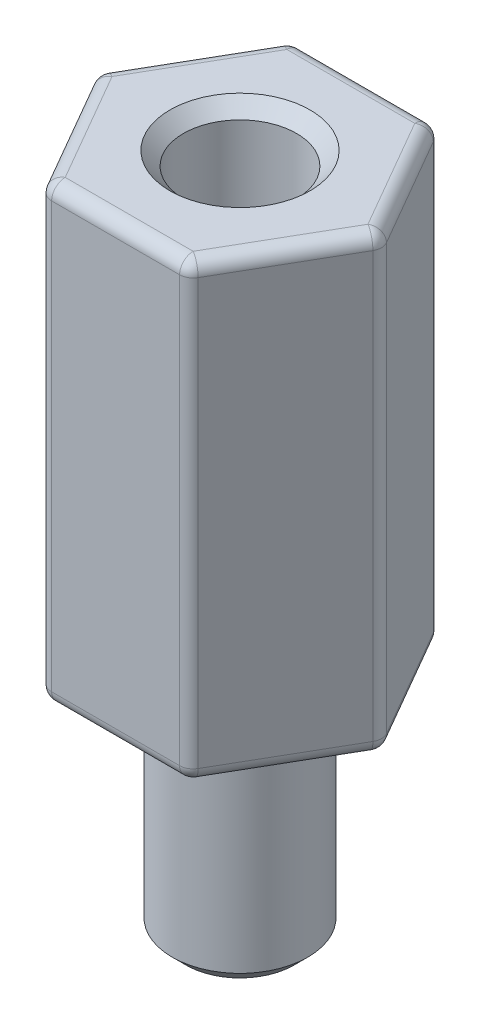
ISO-10303-21;
HEADER;
FILE_DESCRIPTION(('STEP AP214'),'2;1');
FILE_NAME('part.step','',(''),(''),'','','');
FILE_SCHEMA(('AUTOMOTIVE_DESIGN { 1 0 10303 214 1 1 1 1 }'));
ENDSEC;
DATA;
#1=APPLICATION_CONTEXT('core data for automotive mechanical design processes');
#2=APPLICATION_PROTOCOL_DEFINITION('international standard','automotive_design',2000,#1);
#3=PRODUCT_CONTEXT('',#1,'mechanical');
#4=PRODUCT('Part','Part','',(#3));
#5=PRODUCT_RELATED_PRODUCT_CATEGORY('part','',(#4));
#6=PRODUCT_DEFINITION_FORMATION('','',#4);
#7=PRODUCT_DEFINITION_CONTEXT('part definition',#1,'design');
#8=PRODUCT_DEFINITION('design','',#6,#7);
#9=PRODUCT_DEFINITION_SHAPE('','',#8);
#10=(LENGTH_UNIT() NAMED_UNIT(*) SI_UNIT(.MILLI.,.METRE.));
#11=(NAMED_UNIT(*) PLANE_ANGLE_UNIT() SI_UNIT($,.RADIAN.));
#12=(NAMED_UNIT(*) SI_UNIT($,.STERADIAN.) SOLID_ANGLE_UNIT());
#13=UNCERTAINTY_MEASURE_WITH_UNIT(LENGTH_MEASURE(1.E-05),#10,'distance_accuracy_value','');
#14=(GEOMETRIC_REPRESENTATION_CONTEXT(3) GLOBAL_UNCERTAINTY_ASSIGNED_CONTEXT((#13)) GLOBAL_UNIT_ASSIGNED_CONTEXT((#10,
#11,#12)) REPRESENTATION_CONTEXT('',''));
#15=CARTESIAN_POINT('',(0.,0.,0.));
#16=DIRECTION('',(0.,0.,1.));
#17=DIRECTION('',(1.,0.,0.));
#18=AXIS2_PLACEMENT_3D('',#15,#16,#17);
#19=CARTESIAN_POINT('',(0.,10.,0.));
#20=DIRECTION('',(0.,1.,0.));
#21=DIRECTION('',(0.,0.,1.));
#22=AXIS2_PLACEMENT_3D('',#19,#20,#21);
#23=PLANE('',#22);
#24=CARTESIAN_POINT('',(0.,10.,0.));
#25=DIRECTION('',(0.,1.,0.));
#26=DIRECTION('',(0.,0.,1.));
#27=AXIS2_PLACEMENT_3D('',#24,#25,#26);
#28=CIRCLE('',#27,1.55);
#29=CARTESIAN_POINT('',(0.,10.,1.55));
#30=VERTEX_POINT('',#29);
#31=EDGE_CURVE('E285',#30,#30,#28,.F.);
#32=ORIENTED_EDGE('',*,*,#31,.T.);
#33=EDGE_LOOP('',(#32));
#34=FACE_BOUND('',#33,.T.);
#35=DIRECTION('',(-0.5,0.,0.866025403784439));
#36=VECTOR('',#35,1.);
#37=CARTESIAN_POINT('',(-2.82901631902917,10.,0.));
#38=LINE('',#37,#36);
#39=CARTESIAN_POINT('',(-1.41450815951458,10.,-2.45));
#40=VERTEX_POINT('',#39);
#41=CARTESIAN_POINT('',(-2.82901631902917,10.,0.));
#42=VERTEX_POINT('',#41);
#43=EDGE_CURVE('E59',#40,#42,#38,.T.);
#44=ORIENTED_EDGE('',*,*,#43,.T.);
#45=DIRECTION('',(0.5,0.,0.866025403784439));
#46=VECTOR('',#45,1.);
#47=CARTESIAN_POINT('',(-1.41450815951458,10.,2.45));
#48=LINE('',#47,#46);
#49=CARTESIAN_POINT('',(-1.41450815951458,10.,2.45));
#50=VERTEX_POINT('',#49);
#51=EDGE_CURVE('E567',#42,#50,#48,.T.);
#52=ORIENTED_EDGE('',*,*,#51,.T.);
#53=DIRECTION('',(1.,0.,0.));
#54=VECTOR('',#53,1.);
#55=CARTESIAN_POINT('',(1.41450815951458,10.,2.45));
#56=LINE('',#55,#54);
#57=CARTESIAN_POINT('',(1.41450815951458,10.,2.45));
#58=VERTEX_POINT('',#57);
#59=EDGE_CURVE('E559',#50,#58,#56,.T.);
#60=ORIENTED_EDGE('',*,*,#59,.T.);
#61=DIRECTION('',(0.5,0.,-0.866025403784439));
#62=VECTOR('',#61,1.);
#63=CARTESIAN_POINT('',(2.82901631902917,10.,0.));
#64=LINE('',#63,#62);
#65=CARTESIAN_POINT('',(2.82901631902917,10.,0.));
#66=VERTEX_POINT('',#65);
#67=EDGE_CURVE('E561',#58,#66,#64,.T.);
#68=ORIENTED_EDGE('',*,*,#67,.T.);
#69=DIRECTION('',(-0.5,0.,-0.866025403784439));
#70=VECTOR('',#69,1.);
#71=CARTESIAN_POINT('',(1.41450815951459,10.,-2.45));
#72=LINE('',#71,#70);
#73=CARTESIAN_POINT('',(1.41450815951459,10.,-2.45));
#74=VERTEX_POINT('',#73);
#75=EDGE_CURVE('E563',#66,#74,#72,.T.);
#76=ORIENTED_EDGE('',*,*,#75,.T.);
#77=DIRECTION('',(-1.,0.,0.));
#78=VECTOR('',#77,1.);
#79=CARTESIAN_POINT('',(-1.41450815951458,10.,-2.45));
#80=LINE('',#79,#78);
#81=EDGE_CURVE('E64',#74,#40,#80,.T.);
#82=ORIENTED_EDGE('',*,*,#81,.T.);
#83=EDGE_LOOP('',(#44,#52,#60,#68,#76,#82));
#84=FACE_BOUND('',#83,.T.);
#85=ADVANCED_FACE('F44',(#34,#84),#23,.T.);
#86=CARTESIAN_POINT('',(0.,0.,0.));
#87=DIRECTION('',(0.,1.,0.));
#88=DIRECTION('',(0.,0.,1.));
#89=AXIS2_PLACEMENT_3D('',#86,#87,#88);
#90=PLANE('',#89);
#91=CARTESIAN_POINT('',(0.,0.,0.));
#92=DIRECTION('',(0.,1.,0.));
#93=DIRECTION('',(0.,0.,1.));
#94=AXIS2_PLACEMENT_3D('',#91,#92,#93);
#95=CIRCLE('',#94,1.8);
#96=CARTESIAN_POINT('',(0.,0.,1.8));
#97=VERTEX_POINT('',#96);
#98=EDGE_CURVE('E11',#97,#97,#95,.T.);
#99=ORIENTED_EDGE('',*,*,#98,.T.);
#100=EDGE_LOOP('',(#99));
#101=FACE_BOUND('',#100,.T.);
#102=DIRECTION('',(1.,0.,0.));
#103=VECTOR('',#102,1.);
#104=CARTESIAN_POINT('',(0.,0.,2.45));
#105=LINE('',#104,#103);
#106=CARTESIAN_POINT('',(1.41450815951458,0.,2.45));
#107=VERTEX_POINT('',#106);
#108=CARTESIAN_POINT('',(-1.41450815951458,0.,2.45));
#109=VERTEX_POINT('',#108);
#110=EDGE_CURVE('E179',#107,#109,#105,.F.);
#111=ORIENTED_EDGE('',*,*,#110,.T.);
#112=DIRECTION('',(0.5,0.,0.866025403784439));
#113=VECTOR('',#112,1.);
#114=CARTESIAN_POINT('',(-2.12176223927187,0.,1.225));
#115=LINE('',#114,#113);
#116=CARTESIAN_POINT('',(-2.82901631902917,0.,0.));
#117=VERTEX_POINT('',#116);
#118=EDGE_CURVE('E205',#109,#117,#115,.F.);
#119=ORIENTED_EDGE('',*,*,#118,.T.);
#120=DIRECTION('',(-0.5,0.,0.866025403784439));
#121=VECTOR('',#120,1.);
#122=CARTESIAN_POINT('',(-2.12176223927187,0.,-1.225));
#123=LINE('',#122,#121);
#124=CARTESIAN_POINT('',(-1.41450815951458,0.,-2.45));
#125=VERTEX_POINT('',#124);
#126=EDGE_CURVE('E520',#117,#125,#123,.F.);
#127=ORIENTED_EDGE('',*,*,#126,.T.);
#128=DIRECTION('',(-1.,0.,0.));
#129=VECTOR('',#128,1.);
#130=CARTESIAN_POINT('',(0.,0.,-2.45));
#131=LINE('',#130,#129);
#132=CARTESIAN_POINT('',(1.41450815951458,0.,-2.45));
#133=VERTEX_POINT('',#132);
#134=EDGE_CURVE('E518',#125,#133,#131,.F.);
#135=ORIENTED_EDGE('',*,*,#134,.T.);
#136=DIRECTION('',(-0.5,0.,-0.866025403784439));
#137=VECTOR('',#136,1.);
#138=CARTESIAN_POINT('',(2.12176223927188,0.,-1.225));
#139=LINE('',#138,#137);
#140=CARTESIAN_POINT('',(2.82901631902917,0.,0.));
#141=VERTEX_POINT('',#140);
#142=EDGE_CURVE('E516',#133,#141,#139,.F.);
#143=ORIENTED_EDGE('',*,*,#142,.T.);
#144=DIRECTION('',(0.5,0.,-0.866025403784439));
#145=VECTOR('',#144,1.);
#146=CARTESIAN_POINT('',(2.12176223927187,0.,1.225));
#147=LINE('',#146,#145);
#148=EDGE_CURVE('E514',#141,#107,#147,.F.);
#149=ORIENTED_EDGE('',*,*,#148,.T.);
#150=EDGE_LOOP('',(#111,#119,#127,#135,#143,#149));
#151=FACE_BOUND('',#150,.T.);
#152=ADVANCED_FACE('F303',(#101,#151),#90,.F.);
#153=CARTESIAN_POINT('',(1.58771324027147,10.,-2.75));
#154=DIRECTION('',(0.,0.,1.));
#155=DIRECTION('',(1.,0.,0.));
#156=AXIS2_PLACEMENT_3D('',#153,#154,#155);
#157=PLANE('',#156);
#158=DIRECTION('',(0.,-1.,0.));
#159=VECTOR('',#158,1.);
#160=CARTESIAN_POINT('',(1.41450815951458,10.,-2.75));
#161=LINE('',#160,#159);
#162=CARTESIAN_POINT('',(1.41450815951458,9.7,-2.75));
#163=VERTEX_POINT('',#162);
#164=CARTESIAN_POINT('',(1.41450815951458,0.3,-2.75));
#165=VERTEX_POINT('',#164);
#166=EDGE_CURVE('E483',#163,#165,#161,.T.);
#167=ORIENTED_EDGE('',*,*,#166,.T.);
#168=DIRECTION('',(-1.,0.,0.));
#169=VECTOR('',#168,1.);
#170=CARTESIAN_POINT('',(1.58771324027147,0.3,-2.75));
#171=LINE('',#170,#169);
#172=CARTESIAN_POINT('',(-1.41450815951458,0.3,-2.75));
#173=VERTEX_POINT('',#172);
#174=EDGE_CURVE('E537',#165,#173,#171,.T.);
#175=ORIENTED_EDGE('',*,*,#174,.T.);
#176=DIRECTION('',(0.,-1.,0.));
#177=VECTOR('',#176,1.);
#178=CARTESIAN_POINT('',(-1.41450815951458,10.,-2.75));
#179=LINE('',#178,#177);
#180=CARTESIAN_POINT('',(-1.41450815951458,9.7,-2.75));
#181=VERTEX_POINT('',#180);
#182=EDGE_CURVE('E480',#173,#181,#179,.F.);
#183=ORIENTED_EDGE('',*,*,#182,.T.);
#184=DIRECTION('',(-1.,0.,0.));
#185=VECTOR('',#184,1.);
#186=CARTESIAN_POINT('',(1.41450815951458,9.7,-2.75));
#187=LINE('',#186,#185);
#188=EDGE_CURVE('E535',#181,#163,#187,.F.);
#189=ORIENTED_EDGE('',*,*,#188,.T.);
#190=EDGE_LOOP('',(#167,#175,#183,#189));
#191=FACE_BOUND('',#190,.T.);
#192=ADVANCED_FACE('F309',(#191),#157,.F.);
#193=CARTESIAN_POINT('',(-1.58771324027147,10.,-2.75));
#194=DIRECTION('',(0.866025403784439,0.,0.5));
#195=DIRECTION('',(0.5,0.,-0.866025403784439));
#196=AXIS2_PLACEMENT_3D('',#193,#194,#195);
#197=PLANE('',#196);
#198=DIRECTION('',(0.,-1.,0.));
#199=VECTOR('',#198,1.);
#200=CARTESIAN_POINT('',(-1.67431578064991,10.,-2.6));
#201=LINE('',#200,#199);
#202=CARTESIAN_POINT('',(-1.67431578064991,9.7,-2.6));
#203=VERTEX_POINT('',#202);
#204=CARTESIAN_POINT('',(-1.67431578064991,0.3,-2.6));
#205=VERTEX_POINT('',#204);
#206=EDGE_CURVE('E192',#203,#205,#201,.T.);
#207=ORIENTED_EDGE('',*,*,#206,.T.);
#208=DIRECTION('',(-0.5,0.,0.866025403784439));
#209=VECTOR('',#208,1.);
#210=CARTESIAN_POINT('',(-1.58771324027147,0.3,-2.75));
#211=LINE('',#210,#209);
#212=CARTESIAN_POINT('',(-3.0888239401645,0.3,-0.15));
#213=VERTEX_POINT('',#212);
#214=EDGE_CURVE('E529',#205,#213,#211,.T.);
#215=ORIENTED_EDGE('',*,*,#214,.T.);
#216=DIRECTION('',(0.,-1.,0.));
#217=VECTOR('',#216,1.);
#218=CARTESIAN_POINT('',(-3.0888239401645,10.,-0.15));
#219=LINE('',#218,#217);
#220=CARTESIAN_POINT('',(-3.0888239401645,9.7,-0.15));
#221=VERTEX_POINT('',#220);
#222=EDGE_CURVE('E500',#213,#221,#219,.F.);
#223=ORIENTED_EDGE('',*,*,#222,.T.);
#224=DIRECTION('',(-0.5,0.,0.866025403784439));
#225=VECTOR('',#224,1.);
#226=CARTESIAN_POINT('',(-1.67431578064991,9.7,-2.6));
#227=LINE('',#226,#225);
#228=EDGE_CURVE('E527',#221,#203,#227,.F.);
#229=ORIENTED_EDGE('',*,*,#228,.T.);
#230=EDGE_LOOP('',(#207,#215,#223,#229));
#231=FACE_BOUND('',#230,.T.);
#232=ADVANCED_FACE('F330',(#231),#197,.F.);
#233=CARTESIAN_POINT('',(-3.17542648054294,10.,0.));
#234=DIRECTION('',(0.866025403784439,0.,-0.5));
#235=DIRECTION('',(-0.5,0.,-0.866025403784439));
#236=AXIS2_PLACEMENT_3D('',#233,#234,#235);
#237=PLANE('',#236);
#238=DIRECTION('',(0.,-1.,0.));
#239=VECTOR('',#238,1.);
#240=CARTESIAN_POINT('',(-3.0888239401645,10.,0.149999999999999));
#241=LINE('',#240,#239);
#242=CARTESIAN_POINT('',(-3.0888239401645,9.7,0.149999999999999));
#243=VERTEX_POINT('',#242);
#244=CARTESIAN_POINT('',(-3.0888239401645,0.3,0.149999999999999));
#245=VERTEX_POINT('',#244);
#246=EDGE_CURVE('E175',#243,#245,#241,.T.);
#247=ORIENTED_EDGE('',*,*,#246,.T.);
#248=DIRECTION('',(0.5,0.,0.866025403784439));
#249=VECTOR('',#248,1.);
#250=CARTESIAN_POINT('',(-3.17542648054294,0.3,0.));
#251=LINE('',#250,#249);
#252=CARTESIAN_POINT('',(-1.67431578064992,0.3,2.6));
#253=VERTEX_POINT('',#252);
#254=EDGE_CURVE('E170',#245,#253,#251,.T.);
#255=ORIENTED_EDGE('',*,*,#254,.T.);
#256=DIRECTION('',(0.,-1.,0.));
#257=VECTOR('',#256,1.);
#258=CARTESIAN_POINT('',(-1.67431578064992,10.,2.6));
#259=LINE('',#258,#257);
#260=CARTESIAN_POINT('',(-1.67431578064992,9.7,2.6));
#261=VERTEX_POINT('',#260);
#262=EDGE_CURVE('E173',#253,#261,#259,.F.);
#263=ORIENTED_EDGE('',*,*,#262,.T.);
#264=DIRECTION('',(0.5,0.,0.866025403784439));
#265=VECTOR('',#264,1.);
#266=CARTESIAN_POINT('',(-3.0888239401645,9.7,0.149999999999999));
#267=LINE('',#266,#265);
#268=EDGE_CURVE('E180',#261,#243,#267,.F.);
#269=ORIENTED_EDGE('',*,*,#268,.T.);
#270=EDGE_LOOP('',(#247,#255,#263,#269));
#271=FACE_BOUND('',#270,.T.);
#272=ADVANCED_FACE('F172',(#271),#237,.F.);
#273=CARTESIAN_POINT('',(-1.58771324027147,10.,2.75));
#274=DIRECTION('',(0.,0.,-1.));
#275=DIRECTION('',(-1.,0.,0.));
#276=AXIS2_PLACEMENT_3D('',#273,#274,#275);
#277=PLANE('',#276);
#278=DIRECTION('',(0.,-1.,0.));
#279=VECTOR('',#278,1.);
#280=CARTESIAN_POINT('',(-1.41450815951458,10.,2.75));
#281=LINE('',#280,#279);
#282=CARTESIAN_POINT('',(-1.41450815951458,9.7,2.75));
#283=VERTEX_POINT('',#282);
#284=CARTESIAN_POINT('',(-1.41450815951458,0.3,2.75));
#285=VERTEX_POINT('',#284);
#286=EDGE_CURVE('E509',#283,#285,#281,.T.);
#287=ORIENTED_EDGE('',*,*,#286,.T.);
#288=DIRECTION('',(1.,0.,0.));
#289=VECTOR('',#288,1.);
#290=CARTESIAN_POINT('',(-1.58771324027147,0.3,2.75));
#291=LINE('',#290,#289);
#292=CARTESIAN_POINT('',(1.41450815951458,0.3,2.75));
#293=VERTEX_POINT('',#292);
#294=EDGE_CURVE('E214',#285,#293,#291,.T.);
#295=ORIENTED_EDGE('',*,*,#294,.T.);
#296=DIRECTION('',(0.,-1.,0.));
#297=VECTOR('',#296,1.);
#298=CARTESIAN_POINT('',(1.41450815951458,10.,2.75));
#299=LINE('',#298,#297);
#300=CARTESIAN_POINT('',(1.41450815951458,9.7,2.75));
#301=VERTEX_POINT('',#300);
#302=EDGE_CURVE('E506',#293,#301,#299,.F.);
#303=ORIENTED_EDGE('',*,*,#302,.T.);
#304=DIRECTION('',(1.,0.,0.));
#305=VECTOR('',#304,1.);
#306=CARTESIAN_POINT('',(-1.41450815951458,9.7,2.75));
#307=LINE('',#306,#305);
#308=EDGE_CURVE('E568',#301,#283,#307,.F.);
#309=ORIENTED_EDGE('',*,*,#308,.T.);
#310=EDGE_LOOP('',(#287,#295,#303,#309));
#311=FACE_BOUND('',#310,.T.);
#312=ADVANCED_FACE('F323',(#311),#277,.F.);
#313=CARTESIAN_POINT('',(1.58771324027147,10.,2.75));
#314=DIRECTION('',(-0.866025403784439,0.,-0.5));
#315=DIRECTION('',(-0.5,0.,0.866025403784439));
#316=AXIS2_PLACEMENT_3D('',#313,#314,#315);
#317=PLANE('',#316);
#318=DIRECTION('',(0.,-1.,0.));
#319=VECTOR('',#318,1.);
#320=CARTESIAN_POINT('',(1.67431578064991,10.,2.6));
#321=LINE('',#320,#319);
#322=CARTESIAN_POINT('',(1.67431578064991,9.7,2.6));
#323=VERTEX_POINT('',#322);
#324=CARTESIAN_POINT('',(1.67431578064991,0.3,2.6));
#325=VERTEX_POINT('',#324);
#326=EDGE_CURVE('E494',#323,#325,#321,.T.);
#327=ORIENTED_EDGE('',*,*,#326,.T.);
#328=DIRECTION('',(0.5,0.,-0.866025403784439));
#329=VECTOR('',#328,1.);
#330=CARTESIAN_POINT('',(1.58771324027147,0.3,2.75));
#331=LINE('',#330,#329);
#332=CARTESIAN_POINT('',(3.0888239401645,0.3,0.149999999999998));
#333=VERTEX_POINT('',#332);
#334=EDGE_CURVE('E553',#325,#333,#331,.T.);
#335=ORIENTED_EDGE('',*,*,#334,.T.);
#336=DIRECTION('',(0.,-1.,0.));
#337=VECTOR('',#336,1.);
#338=CARTESIAN_POINT('',(3.0888239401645,10.,0.149999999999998));
#339=LINE('',#338,#337);
#340=CARTESIAN_POINT('',(3.0888239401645,9.7,0.149999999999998));
#341=VERTEX_POINT('',#340);
#342=EDGE_CURVE('E497',#333,#341,#339,.F.);
#343=ORIENTED_EDGE('',*,*,#342,.T.);
#344=DIRECTION('',(0.5,0.,-0.866025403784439));
#345=VECTOR('',#344,1.);
#346=CARTESIAN_POINT('',(1.67431578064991,9.7,2.6));
#347=LINE('',#346,#345);
#348=EDGE_CURVE('E551',#341,#323,#347,.F.);
#349=ORIENTED_EDGE('',*,*,#348,.T.);
#350=EDGE_LOOP('',(#327,#335,#343,#349));
#351=FACE_BOUND('',#350,.T.);
#352=ADVANCED_FACE('F319',(#351),#317,.F.);
#353=CARTESIAN_POINT('',(3.17542648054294,10.,0.));
#354=DIRECTION('',(-0.866025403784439,0.,0.5));
#355=DIRECTION('',(0.5,0.,0.866025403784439));
#356=AXIS2_PLACEMENT_3D('',#353,#354,#355);
#357=PLANE('',#356);
#358=DIRECTION('',(0.,-1.,0.));
#359=VECTOR('',#358,1.);
#360=CARTESIAN_POINT('',(3.0888239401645,10.,-0.150000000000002));
#361=LINE('',#360,#359);
#362=CARTESIAN_POINT('',(3.0888239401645,9.7,-0.150000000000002));
#363=VERTEX_POINT('',#362);
#364=CARTESIAN_POINT('',(3.0888239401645,0.3,-0.150000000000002));
#365=VERTEX_POINT('',#364);
#366=EDGE_CURVE('E488',#363,#365,#361,.T.);
#367=ORIENTED_EDGE('',*,*,#366,.T.);
#368=DIRECTION('',(-0.5,0.,-0.866025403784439));
#369=VECTOR('',#368,1.);
#370=CARTESIAN_POINT('',(3.17542648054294,0.3,0.));
#371=LINE('',#370,#369);
#372=CARTESIAN_POINT('',(1.67431578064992,0.3,-2.6));
#373=VERTEX_POINT('',#372);
#374=EDGE_CURVE('E545',#365,#373,#371,.T.);
#375=ORIENTED_EDGE('',*,*,#374,.T.);
#376=DIRECTION('',(0.,-1.,0.));
#377=VECTOR('',#376,1.);
#378=CARTESIAN_POINT('',(1.67431578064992,10.,-2.6));
#379=LINE('',#378,#377);
#380=CARTESIAN_POINT('',(1.67431578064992,9.7,-2.6));
#381=VERTEX_POINT('',#380);
#382=EDGE_CURVE('E491',#373,#381,#379,.F.);
#383=ORIENTED_EDGE('',*,*,#382,.T.);
#384=DIRECTION('',(-0.5,0.,-0.866025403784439));
#385=VECTOR('',#384,1.);
#386=CARTESIAN_POINT('',(3.0888239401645,9.7,-0.150000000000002));
#387=LINE('',#386,#385);
#388=EDGE_CURVE('E543',#381,#363,#387,.F.);
#389=ORIENTED_EDGE('',*,*,#388,.T.);
#390=EDGE_LOOP('',(#367,#375,#383,#389));
#391=FACE_BOUND('',#390,.T.);
#392=ADVANCED_FACE('F316',(#391),#357,.F.);
#393=CARTESIAN_POINT('',(0.,10.,0.));
#394=DIRECTION('',(0.,-1.,0.));
#395=DIRECTION('',(0.,0.,-1.));
#396=AXIS2_PLACEMENT_3D('',#393,#394,#395);
#397=CYLINDRICAL_SURFACE('',#396,1.25);
#398=CARTESIAN_POINT('',(0.,9.7,0.));
#399=DIRECTION('',(0.,1.,0.));
#400=DIRECTION('',(0.,0.,1.));
#401=AXIS2_PLACEMENT_3D('',#398,#399,#400);
#402=CIRCLE('',#401,1.25);
#403=CARTESIAN_POINT('',(0.,9.7,1.25));
#404=VERTEX_POINT('',#403);
#405=EDGE_CURVE('E282',#404,#404,#402,.T.);
#406=ORIENTED_EDGE('',*,*,#405,.T.);
#407=EDGE_LOOP('',(#406));
#408=FACE_BOUND('',#407,.T.);
#409=CARTESIAN_POINT('',(0.,0.,0.));
#410=DIRECTION('',(0.,1.,0.));
#411=DIRECTION('',(0.,0.,1.));
#412=AXIS2_PLACEMENT_3D('',#409,#410,#411);
#413=CIRCLE('',#412,1.25);
#414=CARTESIAN_POINT('',(0.,0.,1.25));
#415=VERTEX_POINT('',#414);
#416=EDGE_CURVE('E245',#415,#415,#413,.T.);
#417=ORIENTED_EDGE('',*,*,#416,.F.);
#418=EDGE_LOOP('',(#417));
#419=FACE_BOUND('',#418,.T.);
#420=ADVANCED_FACE('F313',(#408,#419),#397,.F.);
#421=CARTESIAN_POINT('',(1.41450815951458,10.,-2.45));
#422=DIRECTION('',(0.,-1.,0.));
#423=DIRECTION('',(0.,0.,-1.));
#424=AXIS2_PLACEMENT_3D('',#421,#422,#423);
#425=CYLINDRICAL_SURFACE('',#424,0.3);
#426=ORIENTED_EDGE('',*,*,#382,.F.);
#427=CARTESIAN_POINT('',(1.41450815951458,0.3,-2.45));
#428=DIRECTION('',(0.,-1.,0.));
#429=DIRECTION('',(0.,0.,-1.));
#430=AXIS2_PLACEMENT_3D('',#427,#428,#429);
#431=CIRCLE('',#430,0.3);
#432=EDGE_CURVE('E541',#373,#165,#431,.F.);
#433=ORIENTED_EDGE('',*,*,#432,.T.);
#434=ORIENTED_EDGE('',*,*,#166,.F.);
#435=CARTESIAN_POINT('',(1.41450815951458,9.7,-2.45));
#436=DIRECTION('',(0.,-1.,0.));
#437=DIRECTION('',(0.,0.,-1.));
#438=AXIS2_PLACEMENT_3D('',#435,#436,#437);
#439=CIRCLE('',#438,0.3);
#440=EDGE_CURVE('E539',#163,#381,#439,.T.);
#441=ORIENTED_EDGE('',*,*,#440,.T.);
#442=EDGE_LOOP('',(#426,#433,#434,#441));
#443=FACE_BOUND('',#442,.T.);
#444=ADVANCED_FACE('F337',(#443),#425,.T.);
#445=CARTESIAN_POINT('',(2.82901631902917,10.,0.));
#446=DIRECTION('',(0.,-1.,0.));
#447=DIRECTION('',(0.,0.,-1.));
#448=AXIS2_PLACEMENT_3D('',#445,#446,#447);
#449=CYLINDRICAL_SURFACE('',#448,0.3);
#450=ORIENTED_EDGE('',*,*,#342,.F.);
#451=CARTESIAN_POINT('',(2.82901631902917,0.3,0.));
#452=DIRECTION('',(0.,-1.,0.));
#453=DIRECTION('',(0.,0.,-1.));
#454=AXIS2_PLACEMENT_3D('',#451,#452,#453);
#455=CIRCLE('',#454,0.3);
#456=EDGE_CURVE('E549',#333,#365,#455,.F.);
#457=ORIENTED_EDGE('',*,*,#456,.T.);
#458=ORIENTED_EDGE('',*,*,#366,.F.);
#459=CARTESIAN_POINT('',(2.82901631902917,9.7,0.));
#460=DIRECTION('',(0.,-1.,0.));
#461=DIRECTION('',(0.,0.,-1.));
#462=AXIS2_PLACEMENT_3D('',#459,#460,#461);
#463=CIRCLE('',#462,0.3);
#464=EDGE_CURVE('E547',#363,#341,#463,.T.);
#465=ORIENTED_EDGE('',*,*,#464,.T.);
#466=EDGE_LOOP('',(#450,#457,#458,#465));
#467=FACE_BOUND('',#466,.T.);
#468=ADVANCED_FACE('F340',(#467),#449,.T.);
#469=CARTESIAN_POINT('',(-1.41450815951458,10.,-2.45));
#470=DIRECTION('',(0.,-1.,0.));
#471=DIRECTION('',(0.,0.,-1.));
#472=AXIS2_PLACEMENT_3D('',#469,#470,#471);
#473=CYLINDRICAL_SURFACE('',#472,0.3);
#474=ORIENTED_EDGE('',*,*,#182,.F.);
#475=CARTESIAN_POINT('',(-1.41450815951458,0.3,-2.45));
#476=DIRECTION('',(0.,-1.,0.));
#477=DIRECTION('',(0.,0.,-1.));
#478=AXIS2_PLACEMENT_3D('',#475,#476,#477);
#479=CIRCLE('',#478,0.3);
#480=EDGE_CURVE('E533',#173,#205,#479,.F.);
#481=ORIENTED_EDGE('',*,*,#480,.T.);
#482=ORIENTED_EDGE('',*,*,#206,.F.);
#483=CARTESIAN_POINT('',(-1.41450815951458,9.7,-2.45));
#484=DIRECTION('',(0.,-1.,0.));
#485=DIRECTION('',(0.,0.,-1.));
#486=AXIS2_PLACEMENT_3D('',#483,#484,#485);
#487=CIRCLE('',#486,0.3);
#488=EDGE_CURVE('E531',#203,#181,#487,.T.);
#489=ORIENTED_EDGE('',*,*,#488,.T.);
#490=EDGE_LOOP('',(#474,#481,#482,#489));
#491=FACE_BOUND('',#490,.T.);
#492=ADVANCED_FACE('F344',(#491),#473,.T.);
#493=CARTESIAN_POINT('',(-2.82901631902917,10.,0.));
#494=DIRECTION('',(0.,-1.,0.));
#495=DIRECTION('',(0.,0.,-1.));
#496=AXIS2_PLACEMENT_3D('',#493,#494,#495);
#497=CYLINDRICAL_SURFACE('',#496,0.3);
#498=ORIENTED_EDGE('',*,*,#222,.F.);
#499=CARTESIAN_POINT('',(-2.82901631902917,0.3,0.));
#500=DIRECTION('',(0.,-1.,0.));
#501=DIRECTION('',(0.,0.,-1.));
#502=AXIS2_PLACEMENT_3D('',#499,#500,#501);
#503=CIRCLE('',#502,0.3);
#504=EDGE_CURVE('E525',#213,#245,#503,.F.);
#505=ORIENTED_EDGE('',*,*,#504,.T.);
#506=ORIENTED_EDGE('',*,*,#246,.F.);
#507=CARTESIAN_POINT('',(-2.82901631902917,9.7,0.));
#508=DIRECTION('',(0.,-1.,0.));
#509=DIRECTION('',(0.,0.,-1.));
#510=AXIS2_PLACEMENT_3D('',#507,#508,#509);
#511=CIRCLE('',#510,0.3);
#512=EDGE_CURVE('E523',#243,#221,#511,.T.);
#513=ORIENTED_EDGE('',*,*,#512,.T.);
#514=EDGE_LOOP('',(#498,#505,#506,#513));
#515=FACE_BOUND('',#514,.T.);
#516=ADVANCED_FACE('F348',(#515),#497,.T.);
#517=CARTESIAN_POINT('',(-1.41450815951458,10.,2.45));
#518=DIRECTION('',(0.,-1.,0.));
#519=DIRECTION('',(0.,0.,-1.));
#520=AXIS2_PLACEMENT_3D('',#517,#518,#519);
#521=CYLINDRICAL_SURFACE('',#520,0.3);
#522=ORIENTED_EDGE('',*,*,#262,.F.);
#523=CARTESIAN_POINT('',(-1.41450815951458,0.3,2.45));
#524=DIRECTION('',(0.,-1.,0.));
#525=DIRECTION('',(0.,0.,-1.));
#526=AXIS2_PLACEMENT_3D('',#523,#524,#525);
#527=CIRCLE('',#526,0.3);
#528=EDGE_CURVE('E188',#253,#285,#527,.F.);
#529=ORIENTED_EDGE('',*,*,#528,.T.);
#530=ORIENTED_EDGE('',*,*,#286,.F.);
#531=CARTESIAN_POINT('',(-1.41450815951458,9.7,2.45));
#532=DIRECTION('',(0.,-1.,0.));
#533=DIRECTION('',(0.,0.,-1.));
#534=AXIS2_PLACEMENT_3D('',#531,#532,#533);
#535=CIRCLE('',#534,0.3);
#536=EDGE_CURVE('E191',#283,#261,#535,.T.);
#537=ORIENTED_EDGE('',*,*,#536,.T.);
#538=EDGE_LOOP('',(#522,#529,#530,#537));
#539=FACE_BOUND('',#538,.T.);
#540=ADVANCED_FACE('F186',(#539),#521,.T.);
#541=CARTESIAN_POINT('',(1.41450815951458,10.,2.45));
#542=DIRECTION('',(0.,-1.,0.));
#543=DIRECTION('',(0.,0.,-1.));
#544=AXIS2_PLACEMENT_3D('',#541,#542,#543);
#545=CYLINDRICAL_SURFACE('',#544,0.3);
#546=ORIENTED_EDGE('',*,*,#302,.F.);
#547=CARTESIAN_POINT('',(1.41450815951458,0.3,2.45));
#548=DIRECTION('',(0.,-1.,0.));
#549=DIRECTION('',(0.,0.,-1.));
#550=AXIS2_PLACEMENT_3D('',#547,#548,#549);
#551=CIRCLE('',#550,0.3);
#552=EDGE_CURVE('E557',#293,#325,#551,.F.);
#553=ORIENTED_EDGE('',*,*,#552,.T.);
#554=ORIENTED_EDGE('',*,*,#326,.F.);
#555=CARTESIAN_POINT('',(1.41450815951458,9.7,2.45));
#556=DIRECTION('',(0.,-1.,0.));
#557=DIRECTION('',(0.,0.,-1.));
#558=AXIS2_PLACEMENT_3D('',#555,#556,#557);
#559=CIRCLE('',#558,0.3);
#560=EDGE_CURVE('E555',#323,#301,#559,.T.);
#561=ORIENTED_EDGE('',*,*,#560,.T.);
#562=EDGE_LOOP('',(#546,#553,#554,#561));
#563=FACE_BOUND('',#562,.T.);
#564=ADVANCED_FACE('F355',(#563),#545,.T.);
#565=CARTESIAN_POINT('',(1.41450815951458,0.3,-2.45));
#566=DIRECTION('',(0.,1.,0.));
#567=DIRECTION('',(0.,0.,1.));
#568=AXIS2_PLACEMENT_3D('',#565,#566,#567);
#569=SPHERICAL_SURFACE('',#568,0.3);
#570=CARTESIAN_POINT('',(1.41450815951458,0.3,-2.45));
#571=DIRECTION('',(-1.,0.,0.));
#572=DIRECTION('',(0.,0.,1.));
#573=AXIS2_PLACEMENT_3D('',#570,#571,#572);
#574=CIRCLE('',#573,0.3);
#575=EDGE_CURVE('E239',#165,#133,#574,.T.);
#576=ORIENTED_EDGE('',*,*,#575,.F.);
#577=ORIENTED_EDGE('',*,*,#432,.F.);
#578=CARTESIAN_POINT('',(1.41450815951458,0.3,-2.45));
#579=DIRECTION('',(0.499999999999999,0.,0.866025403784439));
#580=DIRECTION('',(0.866025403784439,0.,-0.499999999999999));
#581=AXIS2_PLACEMENT_3D('',#578,#579,#580);
#582=CIRCLE('',#581,0.3);
#583=EDGE_CURVE('E242',#133,#373,#582,.T.);
#584=ORIENTED_EDGE('',*,*,#583,.F.);
#585=EDGE_LOOP('',(#576,#577,#584));
#586=FACE_BOUND('',#585,.T.);
#587=ADVANCED_FACE('F358',(#586),#569,.T.);
#588=CARTESIAN_POINT('',(2.91561885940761,0.3,0.149999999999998));
#589=DIRECTION('',(-0.5,0.,-0.866025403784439));
#590=DIRECTION('',(-0.866025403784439,0.,0.5));
#591=AXIS2_PLACEMENT_3D('',#588,#589,#590);
#592=CYLINDRICAL_SURFACE('',#591,0.3);
#593=ORIENTED_EDGE('',*,*,#583,.T.);
#594=ORIENTED_EDGE('',*,*,#374,.F.);
#595=CARTESIAN_POINT('',(2.82901631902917,0.3,0.));
#596=DIRECTION('',(0.5,0.,0.866025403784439));
#597=DIRECTION('',(0.866025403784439,0.,-0.5));
#598=AXIS2_PLACEMENT_3D('',#595,#596,#597);
#599=CIRCLE('',#598,0.3);
#600=EDGE_CURVE('E236',#141,#365,#599,.T.);
#601=ORIENTED_EDGE('',*,*,#600,.F.);
#602=ORIENTED_EDGE('',*,*,#142,.F.);
#603=EDGE_LOOP('',(#593,#594,#601,#602));
#604=FACE_BOUND('',#603,.T.);
#605=ADVANCED_FACE('F396',(#604),#592,.T.);
#606=CARTESIAN_POINT('',(1.58771324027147,0.3,-2.45));
#607=DIRECTION('',(-1.,0.,0.));
#608=DIRECTION('',(0.,0.,1.));
#609=AXIS2_PLACEMENT_3D('',#606,#607,#608);
#610=CYLINDRICAL_SURFACE('',#609,0.3);
#611=ORIENTED_EDGE('',*,*,#575,.T.);
#612=ORIENTED_EDGE('',*,*,#134,.F.);
#613=CARTESIAN_POINT('',(-1.41450815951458,0.3,-2.45));
#614=DIRECTION('',(-1.,0.,0.));
#615=DIRECTION('',(0.,-1.,0.));
#616=AXIS2_PLACEMENT_3D('',#613,#614,#615);
#617=CIRCLE('',#616,0.3);
#618=EDGE_CURVE('E233',#173,#125,#617,.T.);
#619=ORIENTED_EDGE('',*,*,#618,.F.);
#620=ORIENTED_EDGE('',*,*,#174,.F.);
#621=EDGE_LOOP('',(#611,#612,#619,#620));
#622=FACE_BOUND('',#621,.T.);
#623=ADVANCED_FACE('F392',(#622),#610,.T.);
#624=CARTESIAN_POINT('',(2.82901631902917,0.3,0.));
#625=DIRECTION('',(0.,1.,0.));
#626=DIRECTION('',(0.,0.,1.));
#627=AXIS2_PLACEMENT_3D('',#624,#625,#626);
#628=SPHERICAL_SURFACE('',#627,0.3);
#629=ORIENTED_EDGE('',*,*,#600,.T.);
#630=ORIENTED_EDGE('',*,*,#456,.F.);
#631=CARTESIAN_POINT('',(2.82901631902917,0.3,0.));
#632=DIRECTION('',(-0.5,0.,0.866025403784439));
#633=DIRECTION('',(0.866025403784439,0.,0.5));
#634=AXIS2_PLACEMENT_3D('',#631,#632,#633);
#635=CIRCLE('',#634,0.3);
#636=EDGE_CURVE('E230',#141,#333,#635,.T.);
#637=ORIENTED_EDGE('',*,*,#636,.F.);
#638=EDGE_LOOP('',(#629,#630,#637));
#639=FACE_BOUND('',#638,.T.);
#640=ADVANCED_FACE('F388',(#639),#628,.T.);
#641=CARTESIAN_POINT('',(-1.41450815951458,0.3,-2.45));
#642=DIRECTION('',(0.,1.,0.));
#643=DIRECTION('',(0.,0.,1.));
#644=AXIS2_PLACEMENT_3D('',#641,#642,#643);
#645=SPHERICAL_SURFACE('',#644,0.3);
#646=ORIENTED_EDGE('',*,*,#480,.F.);
#647=ORIENTED_EDGE('',*,*,#618,.T.);
#648=CARTESIAN_POINT('',(-1.41450815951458,0.3,-2.45));
#649=DIRECTION('',(-0.5,0.,0.866025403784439));
#650=DIRECTION('',(0.866025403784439,0.,0.5));
#651=AXIS2_PLACEMENT_3D('',#648,#649,#650);
#652=CIRCLE('',#651,0.3);
#653=EDGE_CURVE('E227',#205,#125,#652,.T.);
#654=ORIENTED_EDGE('',*,*,#653,.F.);
#655=EDGE_LOOP('',(#646,#647,#654));
#656=FACE_BOUND('',#655,.T.);
#657=ADVANCED_FACE('F384',(#656),#645,.T.);
#658=CARTESIAN_POINT('',(1.32790561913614,0.3,2.6));
#659=DIRECTION('',(0.5,0.,-0.866025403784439));
#660=DIRECTION('',(-0.866025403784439,0.,-0.5));
#661=AXIS2_PLACEMENT_3D('',#658,#659,#660);
#662=CYLINDRICAL_SURFACE('',#661,0.3);
#663=ORIENTED_EDGE('',*,*,#636,.T.);
#664=ORIENTED_EDGE('',*,*,#334,.F.);
#665=CARTESIAN_POINT('',(1.41450815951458,0.3,2.45));
#666=DIRECTION('',(-0.5,0.,0.866025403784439));
#667=DIRECTION('',(0.866025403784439,0.,0.5));
#668=AXIS2_PLACEMENT_3D('',#665,#666,#667);
#669=CIRCLE('',#668,0.3);
#670=EDGE_CURVE('E224',#107,#325,#669,.T.);
#671=ORIENTED_EDGE('',*,*,#670,.F.);
#672=ORIENTED_EDGE('',*,*,#148,.F.);
#673=EDGE_LOOP('',(#663,#664,#671,#672));
#674=FACE_BOUND('',#673,.T.);
#675=ADVANCED_FACE('F380',(#674),#662,.T.);
#676=CARTESIAN_POINT('',(-1.32790561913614,0.3,-2.6));
#677=DIRECTION('',(-0.5,0.,0.866025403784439));
#678=DIRECTION('',(0.866025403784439,0.,0.5));
#679=AXIS2_PLACEMENT_3D('',#676,#677,#678);
#680=CYLINDRICAL_SURFACE('',#679,0.3);
#681=ORIENTED_EDGE('',*,*,#653,.T.);
#682=ORIENTED_EDGE('',*,*,#126,.F.);
#683=CARTESIAN_POINT('',(-2.82901631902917,0.3,0.));
#684=DIRECTION('',(-0.5,0.,0.866025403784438));
#685=DIRECTION('',(0.866025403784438,0.,0.5));
#686=AXIS2_PLACEMENT_3D('',#683,#684,#685);
#687=CIRCLE('',#686,0.3);
#688=EDGE_CURVE('E221',#213,#117,#687,.T.);
#689=ORIENTED_EDGE('',*,*,#688,.F.);
#690=ORIENTED_EDGE('',*,*,#214,.F.);
#691=EDGE_LOOP('',(#681,#682,#689,#690));
#692=FACE_BOUND('',#691,.T.);
#693=ADVANCED_FACE('F376',(#692),#680,.T.);
#694=CARTESIAN_POINT('',(1.41450815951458,0.3,2.45));
#695=DIRECTION('',(0.,1.,0.));
#696=DIRECTION('',(0.,0.,1.));
#697=AXIS2_PLACEMENT_3D('',#694,#695,#696);
#698=SPHERICAL_SURFACE('',#697,0.3);
#699=ORIENTED_EDGE('',*,*,#670,.T.);
#700=ORIENTED_EDGE('',*,*,#552,.F.);
#701=CARTESIAN_POINT('',(1.41450815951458,0.3,2.45));
#702=DIRECTION('',(-1.,0.,0.));
#703=DIRECTION('',(0.,0.,1.));
#704=AXIS2_PLACEMENT_3D('',#701,#702,#703);
#705=CIRCLE('',#704,0.3);
#706=EDGE_CURVE('E218',#107,#293,#705,.T.);
#707=ORIENTED_EDGE('',*,*,#706,.F.);
#708=EDGE_LOOP('',(#699,#700,#707));
#709=FACE_BOUND('',#708,.T.);
#710=ADVANCED_FACE('F372',(#709),#698,.T.);
#711=CARTESIAN_POINT('',(-2.82901631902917,0.3,0.));
#712=DIRECTION('',(0.,1.,0.));
#713=DIRECTION('',(0.,0.,1.));
#714=AXIS2_PLACEMENT_3D('',#711,#712,#713);
#715=SPHERICAL_SURFACE('',#714,0.3);
#716=ORIENTED_EDGE('',*,*,#504,.F.);
#717=ORIENTED_EDGE('',*,*,#688,.T.);
#718=CARTESIAN_POINT('',(-2.82901631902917,0.3,0.));
#719=DIRECTION('',(0.5,0.,0.866025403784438));
#720=DIRECTION('',(0.866025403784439,0.,-0.5));
#721=AXIS2_PLACEMENT_3D('',#718,#719,#720);
#722=CIRCLE('',#721,0.3);
#723=EDGE_CURVE('E208',#245,#117,#722,.T.);
#724=ORIENTED_EDGE('',*,*,#723,.F.);
#725=EDGE_LOOP('',(#716,#717,#724));
#726=FACE_BOUND('',#725,.T.);
#727=ADVANCED_FACE('F368',(#726),#715,.T.);
#728=CARTESIAN_POINT('',(-1.58771324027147,0.3,2.45));
#729=DIRECTION('',(1.,0.,0.));
#730=DIRECTION('',(0.,0.,-1.));
#731=AXIS2_PLACEMENT_3D('',#728,#729,#730);
#732=CYLINDRICAL_SURFACE('',#731,0.3);
#733=ORIENTED_EDGE('',*,*,#706,.T.);
#734=ORIENTED_EDGE('',*,*,#294,.F.);
#735=CARTESIAN_POINT('',(-1.41450815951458,0.3,2.45));
#736=DIRECTION('',(-1.,0.,0.));
#737=DIRECTION('',(0.,0.,1.));
#738=AXIS2_PLACEMENT_3D('',#735,#736,#737);
#739=CIRCLE('',#738,0.3);
#740=EDGE_CURVE('E199',#109,#285,#739,.T.);
#741=ORIENTED_EDGE('',*,*,#740,.F.);
#742=ORIENTED_EDGE('',*,*,#110,.F.);
#743=EDGE_LOOP('',(#733,#734,#741,#742));
#744=FACE_BOUND('',#743,.T.);
#745=ADVANCED_FACE('F365',(#744),#732,.T.);
#746=CARTESIAN_POINT('',(-2.91561885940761,0.3,-0.150000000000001));
#747=DIRECTION('',(0.5,0.,0.866025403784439));
#748=DIRECTION('',(0.866025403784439,0.,-0.5));
#749=AXIS2_PLACEMENT_3D('',#746,#747,#748);
#750=CYLINDRICAL_SURFACE('',#749,0.3);
#751=ORIENTED_EDGE('',*,*,#723,.T.);
#752=ORIENTED_EDGE('',*,*,#118,.F.);
#753=CARTESIAN_POINT('',(-1.41450815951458,0.3,2.45));
#754=DIRECTION('',(0.5,0.,0.866025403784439));
#755=DIRECTION('',(0.866025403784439,0.,-0.5));
#756=AXIS2_PLACEMENT_3D('',#753,#754,#755);
#757=CIRCLE('',#756,0.3);
#758=EDGE_CURVE('E197',#253,#109,#757,.T.);
#759=ORIENTED_EDGE('',*,*,#758,.F.);
#760=ORIENTED_EDGE('',*,*,#254,.F.);
#761=EDGE_LOOP('',(#751,#752,#759,#760));
#762=FACE_BOUND('',#761,.T.);
#763=ADVANCED_FACE('F203',(#762),#750,.T.);
#764=CARTESIAN_POINT('',(-1.41450815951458,0.3,2.45));
#765=DIRECTION('',(0.,1.,0.));
#766=DIRECTION('',(0.,0.,1.));
#767=AXIS2_PLACEMENT_3D('',#764,#765,#766);
#768=SPHERICAL_SURFACE('',#767,0.3);
#769=ORIENTED_EDGE('',*,*,#740,.T.);
#770=ORIENTED_EDGE('',*,*,#528,.F.);
#771=ORIENTED_EDGE('',*,*,#758,.T.);
#772=EDGE_LOOP('',(#769,#770,#771));
#773=FACE_BOUND('',#772,.T.);
#774=ADVANCED_FACE('F196',(#773),#768,.T.);
#775=CARTESIAN_POINT('',(1.41450815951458,9.7,-2.45));
#776=DIRECTION('',(0.,1.,0.));
#777=DIRECTION('',(0.,0.,1.));
#778=AXIS2_PLACEMENT_3D('',#775,#776,#777);
#779=SPHERICAL_SURFACE('',#778,0.3);
#780=CARTESIAN_POINT('',(1.41450815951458,9.7,-2.45));
#781=DIRECTION('',(0.499999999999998,0.,0.86602540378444));
#782=DIRECTION('',(0.86602540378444,0.,-0.499999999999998));
#783=AXIS2_PLACEMENT_3D('',#780,#781,#782);
#784=CIRCLE('',#783,0.3);
#785=EDGE_CURVE('E211',#381,#74,#784,.T.);
#786=ORIENTED_EDGE('',*,*,#785,.F.);
#787=ORIENTED_EDGE('',*,*,#440,.F.);
#788=CARTESIAN_POINT('',(1.41450815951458,9.7,-2.45));
#789=DIRECTION('',(-1.,0.,0.));
#790=DIRECTION('',(0.,0.,1.));
#791=AXIS2_PLACEMENT_3D('',#788,#789,#790);
#792=CIRCLE('',#791,0.3);
#793=EDGE_CURVE('E206',#74,#163,#792,.T.);
#794=ORIENTED_EDGE('',*,*,#793,.F.);
#795=EDGE_LOOP('',(#786,#787,#794));
#796=FACE_BOUND('',#795,.T.);
#797=ADVANCED_FACE('F362',(#796),#779,.T.);
#798=CARTESIAN_POINT('',(0.,9.7,-2.45));
#799=DIRECTION('',(1.,0.,0.));
#800=DIRECTION('',(0.,0.,-1.));
#801=AXIS2_PLACEMENT_3D('',#798,#799,#800);
#802=CYLINDRICAL_SURFACE('',#801,0.3);
#803=ORIENTED_EDGE('',*,*,#793,.T.);
#804=ORIENTED_EDGE('',*,*,#188,.F.);
#805=CARTESIAN_POINT('',(-1.41450815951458,9.7,-2.45));
#806=DIRECTION('',(-1.,0.,0.));
#807=DIRECTION('',(0.,0.,1.));
#808=AXIS2_PLACEMENT_3D('',#805,#806,#807);
#809=CIRCLE('',#808,0.3);
#810=EDGE_CURVE('E271',#40,#181,#809,.T.);
#811=ORIENTED_EDGE('',*,*,#810,.F.);
#812=ORIENTED_EDGE('',*,*,#81,.F.);
#813=EDGE_LOOP('',(#803,#804,#811,#812));
#814=FACE_BOUND('',#813,.T.);
#815=ADVANCED_FACE('F444',(#814),#802,.T.);
#816=CARTESIAN_POINT('',(2.12176223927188,9.7,-1.225));
#817=DIRECTION('',(0.5,0.,0.866025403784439));
#818=DIRECTION('',(0.866025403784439,0.,-0.5));
#819=AXIS2_PLACEMENT_3D('',#816,#817,#818);
#820=CYLINDRICAL_SURFACE('',#819,0.3);
#821=ORIENTED_EDGE('',*,*,#785,.T.);
#822=ORIENTED_EDGE('',*,*,#75,.F.);
#823=CARTESIAN_POINT('',(2.82901631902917,9.7,0.));
#824=DIRECTION('',(0.5,0.,0.866025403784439));
#825=DIRECTION('',(0.866025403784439,0.,-0.5));
#826=AXIS2_PLACEMENT_3D('',#823,#824,#825);
#827=CIRCLE('',#826,0.3);
#828=EDGE_CURVE('E268',#363,#66,#827,.T.);
#829=ORIENTED_EDGE('',*,*,#828,.F.);
#830=ORIENTED_EDGE('',*,*,#388,.F.);
#831=EDGE_LOOP('',(#821,#822,#829,#830));
#832=FACE_BOUND('',#831,.T.);
#833=ADVANCED_FACE('F440',(#832),#820,.T.);
#834=CARTESIAN_POINT('',(-1.41450815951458,9.7,-2.45));
#835=DIRECTION('',(0.,1.,0.));
#836=DIRECTION('',(0.,0.,1.));
#837=AXIS2_PLACEMENT_3D('',#834,#835,#836);
#838=SPHERICAL_SURFACE('',#837,0.3);
#839=ORIENTED_EDGE('',*,*,#810,.T.);
#840=ORIENTED_EDGE('',*,*,#488,.F.);
#841=CARTESIAN_POINT('',(-1.41450815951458,9.7,-2.45));
#842=DIRECTION('',(-0.5,0.,0.866025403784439));
#843=DIRECTION('',(0.866025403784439,0.,0.5));
#844=AXIS2_PLACEMENT_3D('',#841,#842,#843);
#845=CIRCLE('',#844,0.3);
#846=EDGE_CURVE('E265',#40,#203,#845,.T.);
#847=ORIENTED_EDGE('',*,*,#846,.F.);
#848=EDGE_LOOP('',(#839,#840,#847));
#849=FACE_BOUND('',#848,.T.);
#850=ADVANCED_FACE('F436',(#849),#838,.T.);
#851=CARTESIAN_POINT('',(2.82901631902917,9.7,0.));
#852=DIRECTION('',(0.,1.,0.));
#853=DIRECTION('',(0.,0.,1.));
#854=AXIS2_PLACEMENT_3D('',#851,#852,#853);
#855=SPHERICAL_SURFACE('',#854,0.3);
#856=ORIENTED_EDGE('',*,*,#464,.F.);
#857=ORIENTED_EDGE('',*,*,#828,.T.);
#858=CARTESIAN_POINT('',(2.82901631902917,9.7,0.));
#859=DIRECTION('',(-0.5,0.,0.866025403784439));
#860=DIRECTION('',(0.866025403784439,0.,0.5));
#861=AXIS2_PLACEMENT_3D('',#858,#859,#860);
#862=CIRCLE('',#861,0.3);
#863=EDGE_CURVE('E262',#341,#66,#862,.T.);
#864=ORIENTED_EDGE('',*,*,#863,.F.);
#865=EDGE_LOOP('',(#856,#857,#864));
#866=FACE_BOUND('',#865,.T.);
#867=ADVANCED_FACE('F432',(#866),#855,.T.);
#868=CARTESIAN_POINT('',(-2.12176223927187,9.7,-1.225));
#869=DIRECTION('',(0.5,0.,-0.866025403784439));
#870=DIRECTION('',(-0.866025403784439,0.,-0.5));
#871=AXIS2_PLACEMENT_3D('',#868,#869,#870);
#872=CYLINDRICAL_SURFACE('',#871,0.3);
#873=ORIENTED_EDGE('',*,*,#846,.T.);
#874=ORIENTED_EDGE('',*,*,#228,.F.);
#875=CARTESIAN_POINT('',(-2.82901631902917,9.7,0.));
#876=DIRECTION('',(-0.499999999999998,0.,0.86602540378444));
#877=DIRECTION('',(0.86602540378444,0.,0.499999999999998));
#878=AXIS2_PLACEMENT_3D('',#875,#876,#877);
#879=CIRCLE('',#878,0.3);
#880=EDGE_CURVE('E259',#42,#221,#879,.T.);
#881=ORIENTED_EDGE('',*,*,#880,.F.);
#882=ORIENTED_EDGE('',*,*,#43,.F.);
#883=EDGE_LOOP('',(#873,#874,#881,#882));
#884=FACE_BOUND('',#883,.T.);
#885=ADVANCED_FACE('F428',(#884),#872,.T.);
#886=CARTESIAN_POINT('',(2.12176223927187,9.7,1.225));
#887=DIRECTION('',(-0.5,0.,0.866025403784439));
#888=DIRECTION('',(0.866025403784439,0.,0.5));
#889=AXIS2_PLACEMENT_3D('',#886,#887,#888);
#890=CYLINDRICAL_SURFACE('',#889,0.3);
#891=ORIENTED_EDGE('',*,*,#863,.T.);
#892=ORIENTED_EDGE('',*,*,#67,.F.);
#893=CARTESIAN_POINT('',(1.41450815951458,9.7,2.45));
#894=DIRECTION('',(-0.5,0.,0.866025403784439));
#895=DIRECTION('',(0.866025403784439,0.,0.5));
#896=AXIS2_PLACEMENT_3D('',#893,#894,#895);
#897=CIRCLE('',#896,0.3);
#898=EDGE_CURVE('E256',#323,#58,#897,.T.);
#899=ORIENTED_EDGE('',*,*,#898,.F.);
#900=ORIENTED_EDGE('',*,*,#348,.F.);
#901=EDGE_LOOP('',(#891,#892,#899,#900));
#902=FACE_BOUND('',#901,.T.);
#903=ADVANCED_FACE('F424',(#902),#890,.T.);
#904=CARTESIAN_POINT('',(-2.82901631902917,9.7,0.));
#905=DIRECTION('',(0.,1.,0.));
#906=DIRECTION('',(0.,0.,1.));
#907=AXIS2_PLACEMENT_3D('',#904,#905,#906);
#908=SPHERICAL_SURFACE('',#907,0.3);
#909=ORIENTED_EDGE('',*,*,#880,.T.);
#910=ORIENTED_EDGE('',*,*,#512,.F.);
#911=CARTESIAN_POINT('',(-2.82901631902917,9.7,0.));
#912=DIRECTION('',(0.5,0.,0.866025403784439));
#913=DIRECTION('',(0.866025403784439,0.,-0.5));
#914=AXIS2_PLACEMENT_3D('',#911,#912,#913);
#915=CIRCLE('',#914,0.3);
#916=EDGE_CURVE('E253',#42,#243,#915,.T.);
#917=ORIENTED_EDGE('',*,*,#916,.F.);
#918=EDGE_LOOP('',(#909,#910,#917));
#919=FACE_BOUND('',#918,.T.);
#920=ADVANCED_FACE('F420',(#919),#908,.T.);
#921=CARTESIAN_POINT('',(1.41450815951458,9.7,2.45));
#922=DIRECTION('',(0.,1.,0.));
#923=DIRECTION('',(0.,0.,1.));
#924=AXIS2_PLACEMENT_3D('',#921,#922,#923);
#925=SPHERICAL_SURFACE('',#924,0.3);
#926=ORIENTED_EDGE('',*,*,#560,.F.);
#927=ORIENTED_EDGE('',*,*,#898,.T.);
#928=CARTESIAN_POINT('',(1.41450815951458,9.7,2.45));
#929=DIRECTION('',(-1.,0.,0.));
#930=DIRECTION('',(0.,0.,1.));
#931=AXIS2_PLACEMENT_3D('',#928,#929,#930);
#932=CIRCLE('',#931,0.3);
#933=EDGE_CURVE('E250',#301,#58,#932,.T.);
#934=ORIENTED_EDGE('',*,*,#933,.F.);
#935=EDGE_LOOP('',(#926,#927,#934));
#936=FACE_BOUND('',#935,.T.);
#937=ADVANCED_FACE('F416',(#936),#925,.T.);
#938=CARTESIAN_POINT('',(-2.12176223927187,9.7,1.225));
#939=DIRECTION('',(-0.5,0.,-0.866025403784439));
#940=DIRECTION('',(-0.866025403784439,0.,0.5));
#941=AXIS2_PLACEMENT_3D('',#938,#939,#940);
#942=CYLINDRICAL_SURFACE('',#941,0.3);
#943=ORIENTED_EDGE('',*,*,#916,.T.);
#944=ORIENTED_EDGE('',*,*,#268,.F.);
#945=CARTESIAN_POINT('',(-1.41450815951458,9.7,2.45));
#946=DIRECTION('',(0.5,0.,0.866025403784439));
#947=DIRECTION('',(0.866025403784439,0.,-0.5));
#948=AXIS2_PLACEMENT_3D('',#945,#946,#947);
#949=CIRCLE('',#948,0.3);
#950=EDGE_CURVE('E248',#50,#261,#949,.T.);
#951=ORIENTED_EDGE('',*,*,#950,.F.);
#952=ORIENTED_EDGE('',*,*,#51,.F.);
#953=EDGE_LOOP('',(#943,#944,#951,#952));
#954=FACE_BOUND('',#953,.T.);
#955=ADVANCED_FACE('F412',(#954),#942,.T.);
#956=CARTESIAN_POINT('',(0.,9.7,2.45));
#957=DIRECTION('',(-1.,0.,0.));
#958=DIRECTION('',(0.,0.,1.));
#959=AXIS2_PLACEMENT_3D('',#956,#957,#958);
#960=CYLINDRICAL_SURFACE('',#959,0.3);
#961=ORIENTED_EDGE('',*,*,#933,.T.);
#962=ORIENTED_EDGE('',*,*,#59,.F.);
#963=CARTESIAN_POINT('',(-1.41450815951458,9.7,2.45));
#964=DIRECTION('',(-1.,0.,0.));
#965=DIRECTION('',(0.,0.,1.));
#966=AXIS2_PLACEMENT_3D('',#963,#964,#965);
#967=CIRCLE('',#966,0.3);
#968=EDGE_CURVE('E246',#283,#50,#967,.T.);
#969=ORIENTED_EDGE('',*,*,#968,.F.);
#970=ORIENTED_EDGE('',*,*,#308,.F.);
#971=EDGE_LOOP('',(#961,#962,#969,#970));
#972=FACE_BOUND('',#971,.T.);
#973=ADVANCED_FACE('F408',(#972),#960,.T.);
#974=CARTESIAN_POINT('',(-1.41450815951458,9.7,2.45));
#975=DIRECTION('',(0.,1.,0.));
#976=DIRECTION('',(0.,0.,1.));
#977=AXIS2_PLACEMENT_3D('',#974,#975,#976);
#978=SPHERICAL_SURFACE('',#977,0.3);
#979=ORIENTED_EDGE('',*,*,#950,.T.);
#980=ORIENTED_EDGE('',*,*,#536,.F.);
#981=ORIENTED_EDGE('',*,*,#968,.T.);
#982=EDGE_LOOP('',(#979,#980,#981));
#983=FACE_BOUND('',#982,.T.);
#984=ADVANCED_FACE('F404',(#983),#978,.T.);
#985=CARTESIAN_POINT('',(0.,0.,0.));
#986=DIRECTION('',(0.,-1.,0.));
#987=DIRECTION('',(0.,0.,-1.));
#988=AXIS2_PLACEMENT_3D('',#985,#986,#987);
#989=PLANE('',#988);
#990=ORIENTED_EDGE('',*,*,#416,.T.);
#991=EDGE_LOOP('',(#990));
#992=FACE_BOUND('',#991,.T.);
#993=ADVANCED_FACE('F407',(#992),#989,.F.);
#994=CARTESIAN_POINT('',(0.,-5.,0.));
#995=DIRECTION('',(0.,1.,0.));
#996=DIRECTION('',(0.,0.,1.));
#997=AXIS2_PLACEMENT_3D('',#994,#995,#996);
#998=CYLINDRICAL_SURFACE('',#997,1.5);
#999=CARTESIAN_POINT('',(0.,-0.3,0.));
#1000=DIRECTION('',(0.,1.,0.));
#1001=DIRECTION('',(0.,0.,1.));
#1002=AXIS2_PLACEMENT_3D('',#999,#1000,#1001);
#1003=CIRCLE('',#1002,1.5);
#1004=CARTESIAN_POINT('',(0.,-0.3,1.5));
#1005=VERTEX_POINT('',#1004);
#1006=EDGE_CURVE('E52',#1005,#1005,#1003,.F.);
#1007=ORIENTED_EDGE('',*,*,#1006,.T.);
#1008=EDGE_LOOP('',(#1007));
#1009=FACE_BOUND('',#1008,.T.);
#1010=CARTESIAN_POINT('',(0.,-4.7,0.));
#1011=DIRECTION('',(0.,-1.,0.));
#1012=DIRECTION('',(0.,0.,-1.));
#1013=AXIS2_PLACEMENT_3D('',#1010,#1011,#1012);
#1014=CIRCLE('',#1013,1.5);
#1015=CARTESIAN_POINT('',(0.,-4.7,-1.5));
#1016=VERTEX_POINT('',#1015);
#1017=EDGE_CURVE('E279',#1016,#1016,#1014,.F.);
#1018=ORIENTED_EDGE('',*,*,#1017,.T.);
#1019=EDGE_LOOP('',(#1018));
#1020=FACE_BOUND('',#1019,.T.);
#1021=ADVANCED_FACE('F290',(#1009,#1020),#998,.T.);
#1022=CARTESIAN_POINT('',(0.,-5.,0.));
#1023=DIRECTION('',(0.,-1.,0.));
#1024=DIRECTION('',(0.,0.,-1.));
#1025=AXIS2_PLACEMENT_3D('',#1022,#1023,#1024);
#1026=PLANE('',#1025);
#1027=CARTESIAN_POINT('',(0.,-5.,0.));
#1028=DIRECTION('',(0.,-1.,0.));
#1029=DIRECTION('',(0.,0.,-1.));
#1030=AXIS2_PLACEMENT_3D('',#1027,#1028,#1029);
#1031=CIRCLE('',#1030,1.2);
#1032=CARTESIAN_POINT('',(0.,-5.,-1.2));
#1033=VERTEX_POINT('',#1032);
#1034=EDGE_CURVE('E276',#1033,#1033,#1031,.T.);
#1035=ORIENTED_EDGE('',*,*,#1034,.T.);
#1036=EDGE_LOOP('',(#1035));
#1037=FACE_BOUND('',#1036,.T.);
#1038=ADVANCED_FACE('F457',(#1037),#1026,.T.);
#1039=CARTESIAN_POINT('',(0.,-5.,0.));
#1040=DIRECTION('',(0.,1.,0.));
#1041=DIRECTION('',(0.,0.,1.));
#1042=AXIS2_PLACEMENT_3D('',#1039,#1040,#1041);
#1043=CONICAL_SURFACE('',#1042,1.2,0.785398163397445);
#1044=ORIENTED_EDGE('',*,*,#1017,.F.);
#1045=EDGE_LOOP('',(#1044));
#1046=FACE_BOUND('',#1045,.T.);
#1047=ORIENTED_EDGE('',*,*,#1034,.F.);
#1048=EDGE_LOOP('',(#1047));
#1049=FACE_BOUND('',#1048,.T.);
#1050=ADVANCED_FACE('F299',(#1046,#1049),#1043,.T.);
#1051=CARTESIAN_POINT('',(0.,9.7,0.));
#1052=DIRECTION('',(0.,1.,0.));
#1053=DIRECTION('',(0.,0.,1.));
#1054=AXIS2_PLACEMENT_3D('',#1051,#1052,#1053);
#1055=CONICAL_SURFACE('',#1054,1.25,0.78539816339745);
#1056=ORIENTED_EDGE('',*,*,#31,.F.);
#1057=EDGE_LOOP('',(#1056));
#1058=FACE_BOUND('',#1057,.T.);
#1059=ORIENTED_EDGE('',*,*,#405,.F.);
#1060=EDGE_LOOP('',(#1059));
#1061=FACE_BOUND('',#1060,.T.);
#1062=ADVANCED_FACE('F294',(#1058,#1061),#1055,.F.);
#1063=CARTESIAN_POINT('',(0.,-0.3,0.));
#1064=DIRECTION('',(0.,1.,0.));
#1065=DIRECTION('',(0.,0.,1.));
#1066=AXIS2_PLACEMENT_3D('',#1063,#1064,#1065);
#1067=TOROIDAL_SURFACE('',#1066,1.8,0.3);
#1068=ORIENTED_EDGE('',*,*,#98,.F.);
#1069=EDGE_LOOP('',(#1068));
#1070=FACE_BOUND('',#1069,.T.);
#1071=ORIENTED_EDGE('',*,*,#1006,.F.);
#1072=EDGE_LOOP('',(#1071));
#1073=FACE_BOUND('',#1072,.T.);
#1074=ADVANCED_FACE('F46',(#1070,#1073),#1067,.F.);
#1075=CLOSED_SHELL('',(#85,#152,#192,#232,#272,#312,#352,#392,#420,#444,#468,#492,#516,#540,
#564,#587,#605,#623,#640,#657,#675,#693,#710,#727,#745,#763,#774,#797,#815,#833,#850,#867,#885,
#903,#920,#937,#955,#973,#984,#993,#1021,#1038,#1050,#1062,#1074));
#1076=MANIFOLD_SOLID_BREP('B2',#1075);
#1077=ADVANCED_BREP_SHAPE_REPRESENTATION('',(#18,#1076),#14);
#1078=SHAPE_DEFINITION_REPRESENTATION(#9,#1077);
ENDSEC;
END-ISO-10303-21;
